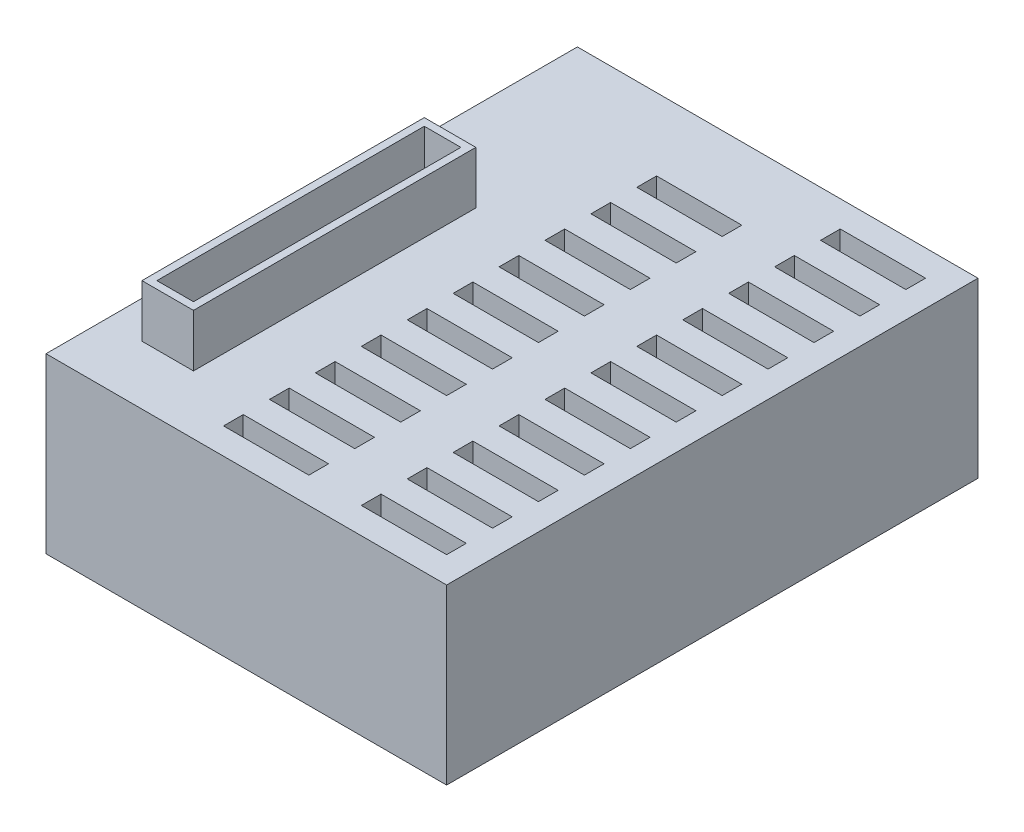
from build123d import *

# Parameters (mm, degrees)
SKETCH1_W           = 150
SKETCH1_H           = 211.5
BOSS_EXTRUDE1_DEPTH = 66.04
SKETCH3_W           = 32.5
SKETCH3_H           = 7.5
CUT_EXTRUDE1_DEPTH  = 13
SKETCH9_W           = 211.5
SKETCH9_H           = 66.04
BOSS_EXTRUDE4_DEPTH = 2.667
SKETCH12_W          = 152.667
SKETCH12_H          = 3.5
CUT_EXTRUDE3_DEPTH  = 184.145100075
SKETCH15_W          = 142.667
SKETCH15_H          = 198
CUT_EXTRUDE4_DEPTH  = 48
SKETCH17_W          = 152.667
SKETCH17_H          = 5.5
CUT_EXTRUDE6_DEPTH  = 184.145100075
SKETCH18_W          = 142.667
SKETCH18_H          = 5
BOSS_EXTRUDE5_DEPTH = 48
SKETCH22_R          = 1.35
CUT_EXTRUDE8_DEPTH  = 10
SKETCH23_W          = 19.64
SKETCH23_H          = 107.6
SKETCH23_W_2        = 13.94
SKETCH23_H_2        = 101.9
BOSS_EXTRUDE6_DEPTH = 20


with BuildPart() as part:
    # Sketch1 → Boss-Extrude1 (new body)
    with BuildSketch(Plane(origin=(0, 0, 0), x_dir=(1, 0, 0), z_dir=(0, 1, 0))):
        with Locations((-30.79316888, -26.224383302)):
            Rectangle(SKETCH1_W, SKETCH1_H)
    extrude(amount=-BOSS_EXTRUDE1_DEPTH)

    # Sketch3 → Cut-Extrude1 (cut)
    with BuildSketch(Plane(origin=(0, 0, 0), x_dir=(1, 0, 0), z_dir=(0, 1, 0))):
        with Locations((-34.54316888, -118.224383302)):
            Rectangle(SKETCH3_W, SKETCH3_H)
        with Locations((17.95683112, -118.224383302)):
            Rectangle(SKETCH3_W, SKETCH3_H)
        with Locations((17.95683112, -100.724383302)):
            Rectangle(SKETCH3_W, SKETCH3_H)
        with Locations((17.95683112, -83.224383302)):
            Rectangle(SKETCH3_W, SKETCH3_H)
        with Locations((17.95683112, -65.724383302)):
            Rectangle(SKETCH3_W, SKETCH3_H)
        with Locations((17.95683112, -48.224383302)):
            Rectangle(SKETCH3_W, SKETCH3_H)
        with Locations((17.95683112, -30.724383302)):
            Rectangle(SKETCH3_W, SKETCH3_H)
        with Locations((17.95683112, -13.224383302)):
            Rectangle(SKETCH3_W, SKETCH3_H)
        with Locations((17.95683112, 4.275616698)):
            Rectangle(SKETCH3_W, SKETCH3_H)
        with Locations((17.95683112, 21.775616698)):
            Rectangle(SKETCH3_W, SKETCH3_H)
        with Locations((17.95683112, 39.275616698)):
            Rectangle(SKETCH3_W, SKETCH3_H)
        with Locations((17.95683112, 56.775616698)):
            Rectangle(SKETCH3_W, SKETCH3_H)
        with Locations((-34.54316888, -100.724383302)):
            Rectangle(SKETCH3_W, SKETCH3_H)
        with Locations((-34.54316888, -83.224383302)):
            Rectangle(SKETCH3_W, SKETCH3_H)
        with Locations((-34.54316888, -65.724383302)):
            Rectangle(SKETCH3_W, SKETCH3_H)
        with Locations((-34.54316888, -48.224383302)):
            Rectangle(SKETCH3_W, SKETCH3_H)
        with Locations((-34.54316888, -30.724383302)):
            Rectangle(SKETCH3_W, SKETCH3_H)
        with Locations((-34.54316888, -13.224383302)):
            Rectangle(SKETCH3_W, SKETCH3_H)
        with Locations((-34.54316888, 4.275616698)):
            Rectangle(SKETCH3_W, SKETCH3_H)
        with Locations((-34.54316888, 21.775616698)):
            Rectangle(SKETCH3_W, SKETCH3_H)
        with Locations((-34.54316888, 39.275616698)):
            Rectangle(SKETCH3_W, SKETCH3_H)
    extrude(amount=-CUT_EXTRUDE1_DEPTH, mode=Mode.SUBTRACT)

    # Sketch9 → Boss-Extrude4 (add)
    with BuildSketch(Plane.ZY.offset(105.79316888)):
        with Locations((26.224383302, -33.02)):
            Rectangle(SKETCH9_W, SKETCH9_H)
    extrude(amount=BOSS_EXTRUDE4_DEPTH)

    # Sketch12 → Cut-Extrude3 (cut, through all)
    with BuildSketch(Plane(origin=(0, 0, 0), x_dir=(1, 0, 0), z_dir=(0, 1, 0))):
        with Locations((-32.12666888, 77.775616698)):
            Rectangle(SKETCH12_W, SKETCH12_H)
    extrude(amount=-CUT_EXTRUDE3_DEPTH, mode=Mode.SUBTRACT)

    # Sketch15 → Cut-Extrude4 (cut)
    with BuildSketch(Plane.XZ.offset(66.04)):
        with Locations((-32.12666888, 27.974383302)):
            Rectangle(SKETCH15_W, SKETCH15_H)
    extrude(amount=-CUT_EXTRUDE4_DEPTH, mode=Mode.SUBTRACT)

    # Sketch17 → Cut-Extrude6 (cut, through all)
    with BuildSketch(Plane(origin=(0, 0, 0), x_dir=(1, 0, 0), z_dir=(0, 1, 0))):
        with Locations((-32.12666888, 73.275616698)):
            Rectangle(SKETCH17_W, SKETCH17_H)
    extrude(amount=-CUT_EXTRUDE6_DEPTH, mode=Mode.SUBTRACT)

    # Sketch18 → Boss-Extrude5 (add)
    with BuildSketch(Plane.XZ.offset(18.04)):
        with Locations((-32.12666888, -68.025616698)):
            Rectangle(SKETCH18_W, SKETCH18_H)
    extrude(amount=BOSS_EXTRUDE5_DEPTH)

    # Sketch22 → Cut-Extrude8 (cut)
    with BuildSketch(Plane.ZY.offset(108.46016888)):
        with Locations((-4.875616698, -6)):
            Circle(SKETCH22_R)
        with Locations((66.324383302, -6)):
            Circle(SKETCH22_R)
    extrude(amount=-CUT_EXTRUDE8_DEPTH, mode=Mode.SUBTRACT)

    # Sketch23 → Boss-Extrude6 (add)
    with BuildSketch(Plane(origin=(0, 0, 0), x_dir=(1, 0, 0), z_dir=(0, 1, 0))):
        with Locations((-84.47939388, -55.774383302)):
            Rectangle(SKETCH23_W, SKETCH23_H)
        with Locations((-84.47939388, -55.774383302)):
            Rectangle(SKETCH23_W_2, SKETCH23_H_2, mode=Mode.SUBTRACT)
    extrude(amount=BOSS_EXTRUDE6_DEPTH)


solid = part.part
